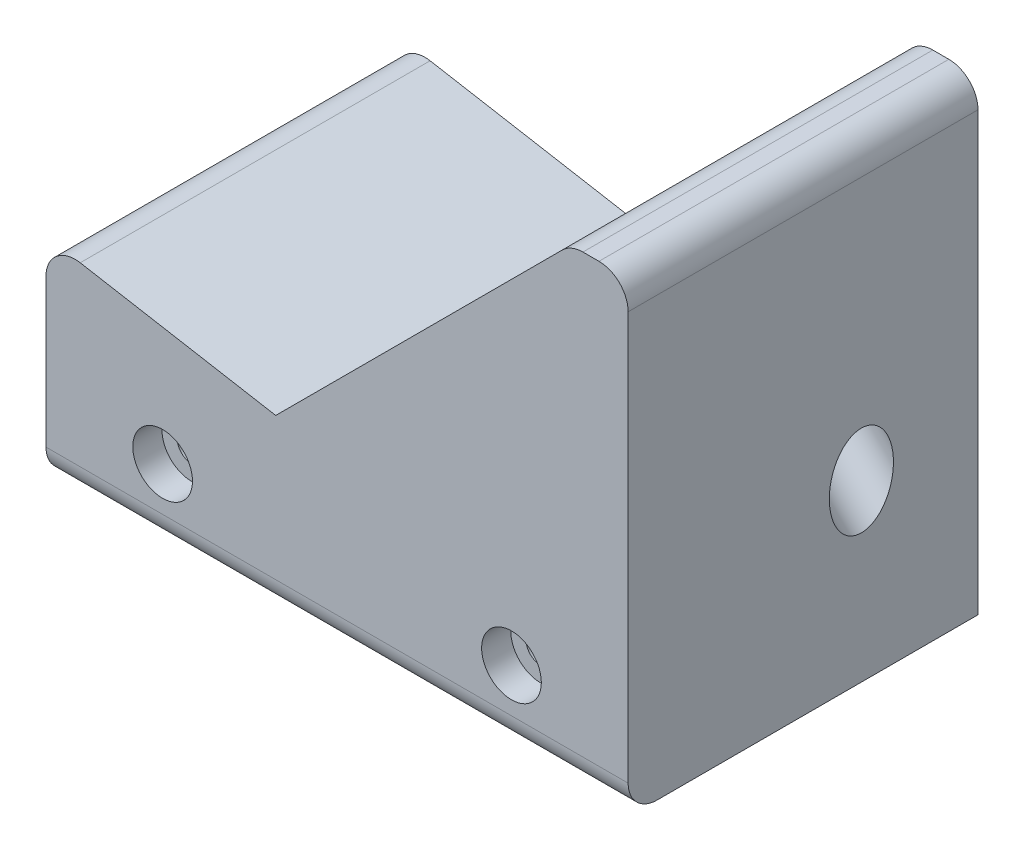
from build123d import *

# Parameters (mm, degrees)
BOSS_EXTRUDE1_DEPTH      = 12.7
BOSS_EXTRUDE1_DEPTH_BACK = 76.2
FILLET1_R                = 6.35
SKETCH2_R                = 6.985
CUT_EXTRUDE1_DEPTH       = 937.932529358
CUT_EXTRUDE3_DEPTH       = 12.7
SKETCH5_R                = 3.175
CUT_EXTRUDE4_DEPTH       = 1262.20655723
SKETCH6_R                = 6.49986
CUT_EXTRUDE5_DEPTH       = 6.35


with BuildPart() as part:
    # Sketch1 → Boss-Extrude1 (new, two sides: drawn at the far end of the back side and taken through both)
    with BuildSketch(Plane.XY.offset(-BOSS_EXTRUDE1_DEPTH_BACK)):
        Polygon((-63.5, 1155.7), (-63.5, 1201.849561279), (-13.471766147, 1193.028233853), (50.8, 1257.3), (63.274359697, 1257.3), (63.274359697, 1155.7), align=None)
    extrude(amount=BOSS_EXTRUDE1_DEPTH + BOSS_EXTRUDE1_DEPTH_BACK)

    # Fillet1
    fillet1_edges = [part.edges().sort_by_distance(p)[0] for p in [
        (63.274359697, 1257.3, -31.75),
        (50.8, 1257.3, -31.75),
        (-63.5, 1201.849561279, -31.75),
        (-0.112820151, 1155.7, 12.7),
    ]]
    fillet(fillet1_edges, radius=FILLET1_R)

    # Sketch2 → Cut-Extrude1 (cut, through all)
    with BuildSketch(Plane(origin=(-603.25, 603.25, 0), x_dir=(0, 0, 1), z_dir=(-0.7071067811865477, 0.7071067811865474, 0))):
        with Locations(Location((-38.1, 888.839857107, 0), (0, 0, 270))):
            Circle(SKETCH2_R)
    extrude(amount=-CUT_EXTRUDE1_DEPTH, mode=Mode.SUBTRACT)

    # Sketch4 → Cut-Extrude3 (cut)
    with BuildSketch(Plane(origin=(0, 0, -76.2), x_dir=(-1, 0, 0), z_dir=(0, 0, -1))):
        with BuildLine():
            Line((-53.430256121, 1257.3), (-56.924359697, 1257.3))
            ThreePointArc((-56.924359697, 1257.3), (-61.414487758, 1255.440128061), (-63.274359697, 1250.95))
            Line((-63.274359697, 1250.95), (-63.274359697, 1155.7))
            Line((-63.274359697, 1155.7), (63.5, 1155.7))
            Line((63.5, 1155.7), (63.5, 1194.281925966))
            ThreePointArc((63.5, 1194.281925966), (61.231701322, 1199.146308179), (56.047334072, 1200.535455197))
            Line((56.047334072, 1200.535455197), (13.471766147, 1193.028233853))
            Line((13.471766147, 1193.028233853), (-48.940128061, 1255.440128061))
            ThreePointArc((-48.940128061, 1255.440128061), (-51.000216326, 1256.816635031), (-53.430256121, 1257.3))
        make_face()
    extrude(amount=-CUT_EXTRUDE3_DEPTH, mode=Mode.SUBTRACT)

    # Sketch5 → Cut-Extrude4 (cut, through all)
    with BuildSketch(Plane.XY.offset(12.7)):
        with Locations((-38.1, 1171.575)):
            Circle(SKETCH5_R)
        with Locations((37.874359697, 1171.575)):
            Circle(SKETCH5_R)
    extrude(amount=-CUT_EXTRUDE4_DEPTH, mode=Mode.SUBTRACT)

    # Sketch6 → Cut-Extrude5 (cut)
    with BuildSketch(Plane.XY.offset(12.7)):
        with Locations((37.874359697, 1171.575)):
            Circle(SKETCH6_R)
        with Locations((-38.1, 1171.575)):
            Circle(SKETCH6_R)
    extrude(amount=-CUT_EXTRUDE5_DEPTH, mode=Mode.SUBTRACT)


solid = part.part
